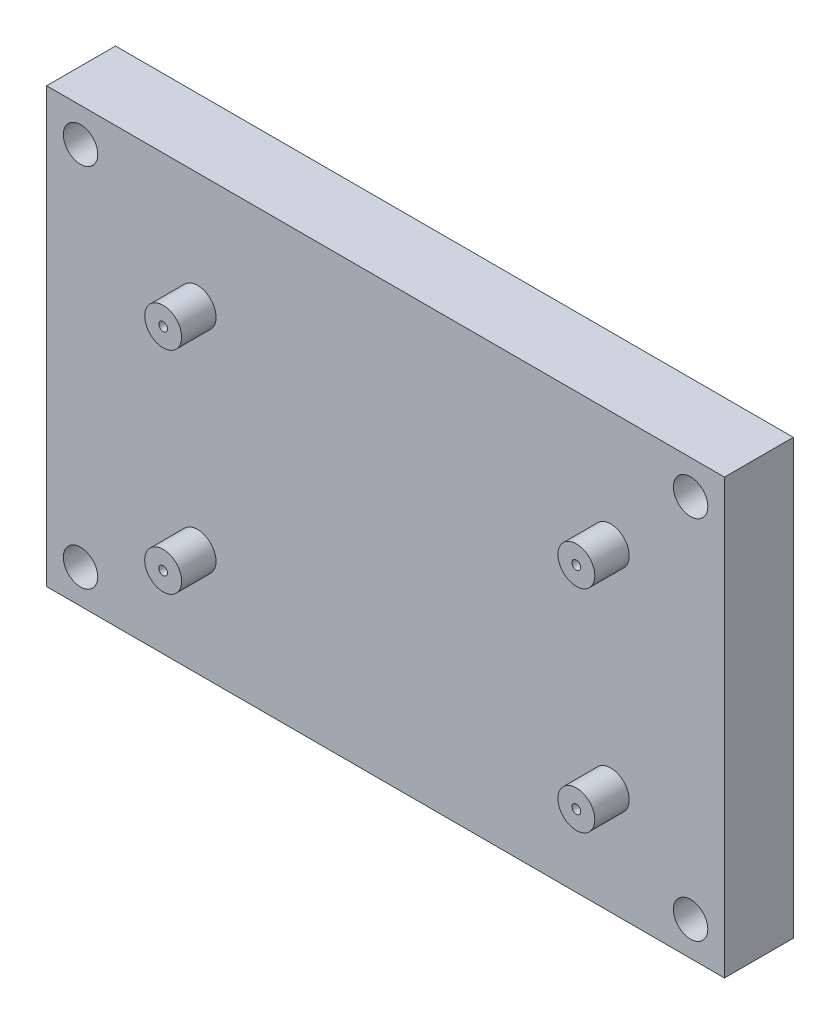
from build123d import *

# Parameters (mm, degrees)
SKETCH1_W                    = 125
SKETCH1_H                    = 80
BOSS_EXTRUDE1_DEPTH          = 12.7
SKETCH2_R                    = 3.175
CUT_EXTRUDE1_DEPTH           = 149.950629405
SKETCH3_R                    = 3.40194036
BOSS_EXTRUDE2_DEPTH          = 6.35
F_52_0_0635_DIAMETER_HOLE1_D = 1.6129


with BuildPart() as part:
    # Sketch1 → Boss-Extrude1 (new body)
    with BuildSketch(Plane.XY):
        with Locations((62.5, 40)):
            Rectangle(SKETCH1_W, SKETCH1_H)
    extrude(amount=BOSS_EXTRUDE1_DEPTH)

    # Sketch2 → Cut-Extrude1 (cut, through all)
    with BuildSketch(Plane.XY.offset(12.7)):
        with Locations((118.75, 73.75)):
            Circle(SKETCH2_R)
        with Locations((6.25, 6.25)):
            Circle(SKETCH2_R)
        with Locations((118.75, 6.25)):
            Circle(SKETCH2_R)
        with Locations((6.25, 73.75)):
            Circle(SKETCH2_R)
    extrude(amount=-CUT_EXTRUDE1_DEPTH, mode=Mode.SUBTRACT)

    # Sketch3 → Boss-Extrude2 (add)
    with BuildSketch(Plane.XY.offset(12.7)):
        with Locations(Location((27.836070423, 58.636126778, 0), (0, 0, 180))):
            Circle(SKETCH3_R)
        with Locations(Location((104.036070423, 58.636126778, 0), (0, 0, 180))):
            Circle(SKETCH3_R)
        with Locations(Location((27.833280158, 19.656126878, 0), (0, 0, 180))):
            Circle(SKETCH3_R)
        with Locations(Location((104.033280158, 19.656126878, 0), (0, 0, 180))):
            Circle(SKETCH3_R)
    extrude(amount=BOSS_EXTRUDE2_DEPTH)

    # 52 _0.0635_ Diameter Hole1 (through all)
    with Locations(Plane(origin=(27.836070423, 58.636126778, 19.05), x_dir=(1, 0, 0), z_dir=(0, 0, 1))):
        with Locations((0, 0), (76.2, 0), (-0.002790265, -38.9799999), (76.197209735, -38.9799999)):
            Hole(F_52_0_0635_DIAMETER_HOLE1_D / 2)


solid = part.part
